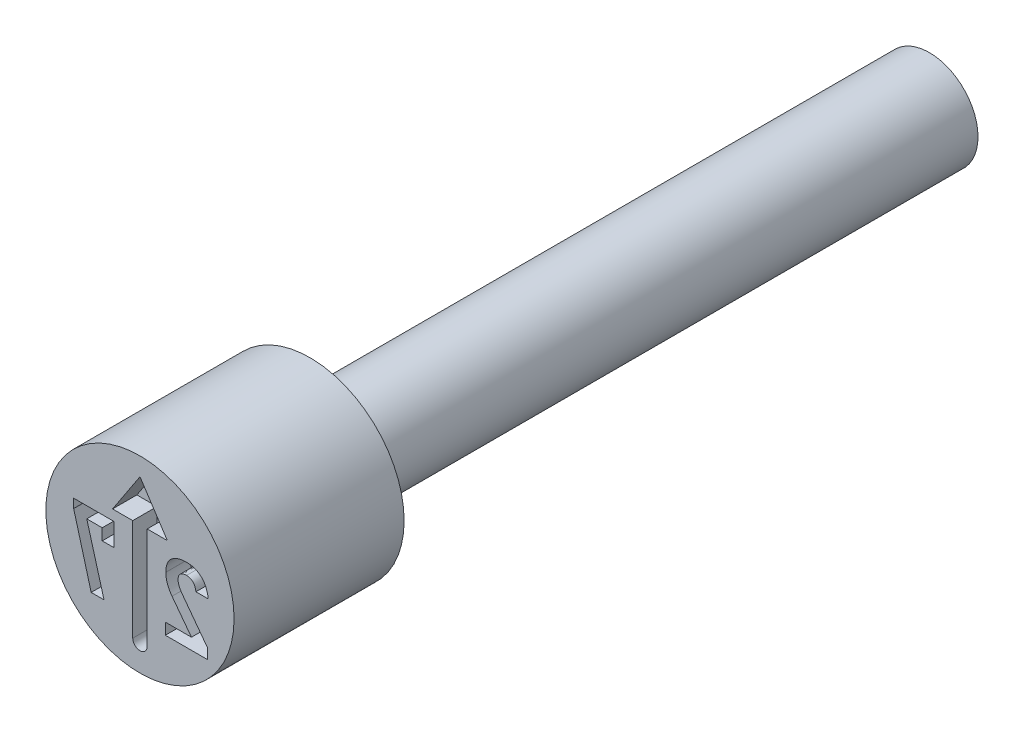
ISO-10303-21;
HEADER;
FILE_DESCRIPTION(('STEP AP214'),'2;1');
FILE_NAME('part.step','',(''),(''),'','','');
FILE_SCHEMA(('AUTOMOTIVE_DESIGN { 1 0 10303 214 1 1 1 1 }'));
ENDSEC;
DATA;
#1=APPLICATION_CONTEXT('core data for automotive mechanical design processes');
#2=APPLICATION_PROTOCOL_DEFINITION('international standard','automotive_design',2000,#1);
#3=PRODUCT_CONTEXT('',#1,'mechanical');
#4=PRODUCT('Part','Part','',(#3));
#5=PRODUCT_RELATED_PRODUCT_CATEGORY('part','',(#4));
#6=PRODUCT_DEFINITION_FORMATION('','',#4);
#7=PRODUCT_DEFINITION_CONTEXT('part definition',#1,'design');
#8=PRODUCT_DEFINITION('design','',#6,#7);
#9=PRODUCT_DEFINITION_SHAPE('','',#8);
#10=(LENGTH_UNIT() NAMED_UNIT(*) SI_UNIT(.MILLI.,.METRE.));
#11=(NAMED_UNIT(*) PLANE_ANGLE_UNIT() SI_UNIT($,.RADIAN.));
#12=(NAMED_UNIT(*) SI_UNIT($,.STERADIAN.) SOLID_ANGLE_UNIT());
#13=UNCERTAINTY_MEASURE_WITH_UNIT(LENGTH_MEASURE(1.E-05),#10,'distance_accuracy_value','');
#14=(GEOMETRIC_REPRESENTATION_CONTEXT(3) GLOBAL_UNCERTAINTY_ASSIGNED_CONTEXT((#13)) GLOBAL_UNIT_ASSIGNED_CONTEXT((#10,
#11,#12)) REPRESENTATION_CONTEXT('',''));
#15=CARTESIAN_POINT('',(0.,0.,0.));
#16=DIRECTION('',(0.,0.,1.));
#17=DIRECTION('',(1.,0.,0.));
#18=AXIS2_PLACEMENT_3D('',#15,#16,#17);
#19=CARTESIAN_POINT('',(0.,0.799999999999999,-2.8));
#20=DIRECTION('',(0.,0.,1.));
#21=DIRECTION('',(1.,0.,0.));
#22=AXIS2_PLACEMENT_3D('',#19,#20,#21);
#23=PLANE('',#22);
#24=CARTESIAN_POINT('',(0.,0.,-2.8));
#25=DIRECTION('',(0.,0.,1.));
#26=DIRECTION('',(1.,0.,0.));
#27=AXIS2_PLACEMENT_3D('',#24,#25,#26);
#28=CIRCLE('',#27,1.55);
#29=CARTESIAN_POINT('',(1.55,0.,-2.8));
#30=VERTEX_POINT('',#29);
#31=EDGE_CURVE('E11',#30,#30,#28,.T.);
#32=ORIENTED_EDGE('',*,*,#31,.F.);
#33=EDGE_LOOP('',(#32));
#34=FACE_BOUND('',#33,.T.);
#35=CARTESIAN_POINT('',(0.,0.,-2.8));
#36=DIRECTION('',(0.,0.,1.));
#37=DIRECTION('',(1.,0.,0.));
#38=AXIS2_PLACEMENT_3D('',#35,#36,#37);
#39=CIRCLE('',#38,0.799999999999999);
#40=CARTESIAN_POINT('',(0.799999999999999,0.,-2.8));
#41=VERTEX_POINT('',#40);
#42=EDGE_CURVE('E405',#41,#41,#39,.T.);
#43=ORIENTED_EDGE('',*,*,#42,.T.);
#44=EDGE_LOOP('',(#43));
#45=FACE_BOUND('',#44,.T.);
#46=ADVANCED_FACE('F39',(#34,#45),#23,.F.);
#47=CARTESIAN_POINT('',(0.,0.,-0.403888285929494));
#48=DIRECTION('',(0.,0.,1.));
#49=DIRECTION('',(1.,0.,0.));
#50=AXIS2_PLACEMENT_3D('',#47,#48,#49);
#51=CYLINDRICAL_SURFACE('',#50,1.55);
#52=CARTESIAN_POINT('',(0.,0.,0.));
#53=DIRECTION('',(0.,0.,1.));
#54=DIRECTION('',(1.,0.,0.));
#55=AXIS2_PLACEMENT_3D('',#52,#53,#54);
#56=CIRCLE('',#55,1.55);
#57=CARTESIAN_POINT('',(1.55,0.,0.));
#58=VERTEX_POINT('',#57);
#59=EDGE_CURVE('E46',#58,#58,#56,.T.);
#60=ORIENTED_EDGE('',*,*,#59,.F.);
#61=EDGE_LOOP('',(#60));
#62=FACE_BOUND('',#61,.T.);
#63=ORIENTED_EDGE('',*,*,#31,.T.);
#64=EDGE_LOOP('',(#63));
#65=FACE_BOUND('',#64,.T.);
#66=ADVANCED_FACE('F390',(#62,#65),#51,.T.);
#67=CARTESIAN_POINT('',(0.,1.55,0.));
#68=DIRECTION('',(0.,0.,-1.));
#69=DIRECTION('',(-1.,0.,0.));
#70=AXIS2_PLACEMENT_3D('',#67,#68,#69);
#71=PLANE('',#70);
#72=DIRECTION('',(0.,1.,0.));
#73=VECTOR('',#72,1.);
#74=CARTESIAN_POINT('',(1.1086504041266,-0.8,0.));
#75=LINE('',#74,#73);
#76=CARTESIAN_POINT('',(1.1086504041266,-0.8,0.));
#77=VERTEX_POINT('',#76);
#78=CARTESIAN_POINT('',(1.1086504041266,-0.626866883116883,0.));
#79=VERTEX_POINT('',#78);
#80=EDGE_CURVE('E640',#77,#79,#75,.T.);
#81=ORIENTED_EDGE('',*,*,#80,.F.);
#82=DIRECTION('',(1.,0.,0.));
#83=VECTOR('',#82,1.);
#84=CARTESIAN_POINT('',(0.418309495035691,-0.8,0.));
#85=LINE('',#84,#83);
#86=CARTESIAN_POINT('',(0.418309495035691,-0.8,0.));
#87=VERTEX_POINT('',#86);
#88=EDGE_CURVE('E53',#87,#77,#85,.T.);
#89=ORIENTED_EDGE('',*,*,#88,.F.);
#90=DIRECTION('',(0.,-1.,0.));
#91=VECTOR('',#90,1.);
#92=CARTESIAN_POINT('',(0.418309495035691,-0.612987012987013,0.));
#93=LINE('',#92,#91);
#94=CARTESIAN_POINT('',(0.418309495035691,-0.612987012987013,0.));
#95=VERTEX_POINT('',#94);
#96=EDGE_CURVE('E274',#95,#87,#93,.T.);
#97=ORIENTED_EDGE('',*,*,#96,.F.);
#98=DIRECTION('',(-1.,0.,0.));
#99=VECTOR('',#98,1.);
#100=CARTESIAN_POINT('',(0.848098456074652,-0.612987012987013,0.));
#101=LINE('',#100,#99);
#102=CARTESIAN_POINT('',(0.848098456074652,-0.612987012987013,0.));
#103=VERTEX_POINT('',#102);
#104=EDGE_CURVE('E277',#103,#95,#101,.T.);
#105=ORIENTED_EDGE('',*,*,#104,.F.);
#106=DIRECTION('',(0.601464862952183,-0.798899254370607,0.));
#107=VECTOR('',#106,1.);
#108=CARTESIAN_POINT('',(0.528374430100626,-0.188311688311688,0.));
#109=LINE('',#108,#107);
#110=CARTESIAN_POINT('',(0.528374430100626,-0.188311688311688,0.));
#111=VERTEX_POINT('',#110);
#112=EDGE_CURVE('E571',#111,#103,#109,.T.);
#113=ORIENTED_EDGE('',*,*,#112,.F.);
#114=CARTESIAN_POINT('',(0.424884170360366,0.100487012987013,0.));
#115=CARTESIAN_POINT('',(0.425203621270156,0.0882106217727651,0.));
#116=CARTESIAN_POINT('',(0.425845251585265,0.0635529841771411,0.));
#117=CARTESIAN_POINT('',(0.431394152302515,0.0264532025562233,0.));
#118=CARTESIAN_POINT('',(0.439406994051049,-0.011031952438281,0.));
#119=CARTESIAN_POINT('',(0.4515866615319,-0.0483617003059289,0.));
#120=CARTESIAN_POINT('',(0.466255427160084,-0.0853237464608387,0.));
#121=CARTESIAN_POINT('',(0.484140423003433,-0.121075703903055,0.));
#122=CARTESIAN_POINT('',(0.504550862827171,-0.155723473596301,0.));
#123=CARTESIAN_POINT('',(0.520395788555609,-0.177397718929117,0.));
#124=CARTESIAN_POINT('',(0.528374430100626,-0.188311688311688,0.));
#125=B_SPLINE_CURVE_WITH_KNOTS('',3,(#114,#115,#116,#117,#118,#119,#120,#121,#122,#123,#124),
.UNSPECIFIED.,.F.,.F.,(4,1,1,1,1,1,1,1,4),(0.,0.117962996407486,0.236933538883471,
0.360005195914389,0.486119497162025,0.613931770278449,0.74201296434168,0.870091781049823,1.),.UNSPECIFIED.);
#126=CARTESIAN_POINT('',(0.424884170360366,0.100487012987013,0.));
#127=VERTEX_POINT('',#126);
#128=EDGE_CURVE('E574',#127,#111,#125,.T.);
#129=ORIENTED_EDGE('',*,*,#128,.F.);
#130=DIRECTION('',(0.,-1.,0.));
#131=VECTOR('',#130,1.);
#132=CARTESIAN_POINT('',(0.424884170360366,0.101217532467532,0.));
#133=LINE('',#132,#131);
#134=CARTESIAN_POINT('',(0.424884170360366,0.101217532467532,0.));
#135=VERTEX_POINT('',#134);
#136=EDGE_CURVE('E579',#135,#127,#133,.T.);
#137=ORIENTED_EDGE('',*,*,#136,.F.);
#138=CARTESIAN_POINT('',(0.769932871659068,0.415584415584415,0.));
#139=CARTESIAN_POINT('',(0.756529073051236,0.415389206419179,0.));
#140=CARTESIAN_POINT('',(0.730472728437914,0.415009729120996,0.));
#141=CARTESIAN_POINT('',(0.692635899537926,0.410971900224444,0.));
#142=CARTESIAN_POINT('',(0.657096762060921,0.404770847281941,0.));
#143=CARTESIAN_POINT('',(0.623885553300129,0.395815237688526,0.));
#144=CARTESIAN_POINT('',(0.593068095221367,0.384102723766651,0.));
#145=CARTESIAN_POINT('',(0.564615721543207,0.369880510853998,0.));
#146=CARTESIAN_POINT('',(0.53834281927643,0.353356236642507,0.));
#147=CARTESIAN_POINT('',(0.514638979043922,0.333969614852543,0.));
#148=CARTESIAN_POINT('',(0.493470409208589,0.312341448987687,0.));
#149=CARTESIAN_POINT('',(0.474950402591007,0.288551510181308,0.));
#150=CARTESIAN_POINT('',(0.459663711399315,0.262394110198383,0.));
#151=CARTESIAN_POINT('',(0.446516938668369,0.234396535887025,0.));
#152=CARTESIAN_POINT('',(0.437000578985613,0.203950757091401,0.));
#153=CARTESIAN_POINT('',(0.429837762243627,0.171627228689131,0.));
#154=CARTESIAN_POINT('',(0.425738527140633,0.137117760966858,0.));
#155=CARTESIAN_POINT('',(0.425174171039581,0.113403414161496,0.));
#156=CARTESIAN_POINT('',(0.424884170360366,0.101217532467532,0.));
#157=B_SPLINE_CURVE_WITH_KNOTS('',3,(#138,#139,#140,#141,#142,#143,#144,#145,#146,#147,#148,
#149,#150,#151,#152,#153,#154,#155,#156),.UNSPECIFIED.,.F.,.F.,(4,1,1,1,1,1,1,1,1,1,1,1,1,1,1,1,
4),(0.,0.0757177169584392,0.147191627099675,0.214761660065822,0.279410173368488,
0.341256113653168,0.400743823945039,0.458895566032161,0.516277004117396,0.573364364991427,
0.629605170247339,0.686164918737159,0.744246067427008,0.804009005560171,0.865999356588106,
0.931142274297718,1.),.UNSPECIFIED.);
#158=CARTESIAN_POINT('',(0.769932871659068,0.415584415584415,0.));
#159=VERTEX_POINT('',#158);
#160=EDGE_CURVE('E585',#159,#135,#157,.T.);
#161=ORIENTED_EDGE('',*,*,#160,.F.);
#162=CARTESIAN_POINT('',(1.12326079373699,0.0719967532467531,0.));
#163=CARTESIAN_POINT('',(1.12170313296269,0.0853448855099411,0.));
#164=CARTESIAN_POINT('',(1.11866286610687,0.111397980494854,0.));
#165=CARTESIAN_POINT('',(1.11039367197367,0.148941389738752,0.));
#166=CARTESIAN_POINT('',(1.10027587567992,0.184247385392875,0.));
#167=CARTESIAN_POINT('',(1.08760022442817,0.217269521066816,0.));
#168=CARTESIAN_POINT('',(1.07247363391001,0.247960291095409,0.));
#169=CARTESIAN_POINT('',(1.05523393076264,0.276546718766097,0.));
#170=CARTESIAN_POINT('',(1.03502060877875,0.302342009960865,0.));
#171=CARTESIAN_POINT('',(1.01296453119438,0.326116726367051,0.));
#172=CARTESIAN_POINT('',(0.988500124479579,0.347012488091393,0.));
#173=CARTESIAN_POINT('',(0.962338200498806,0.36538319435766,0.));
#174=CARTESIAN_POINT('',(0.934484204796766,0.381067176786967,0.));
#175=CARTESIAN_POINT('',(0.904847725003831,0.39378774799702,0.));
#176=CARTESIAN_POINT('',(0.873474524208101,0.403470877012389,0.));
#177=CARTESIAN_POINT('',(0.840489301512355,0.410575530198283,0.));
#178=CARTESIAN_POINT('',(0.805752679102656,0.414719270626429,0.));
#179=CARTESIAN_POINT('',(0.782038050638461,0.415292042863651,0.));
#180=CARTESIAN_POINT('',(0.769932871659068,0.415584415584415,0.));
#181=B_SPLINE_CURVE_WITH_KNOTS('',3,(#162,#163,#164,#165,#166,#167,#168,#169,#170,#171,#172,
#173,#174,#175,#176,#177,#178,#179,#180),.UNSPECIFIED.,.F.,.F.,(4,1,1,1,1,1,1,1,1,1,1,1,1,1,1,1,
4),(0.,0.0735286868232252,0.143514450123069,0.210169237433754,0.274454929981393,
0.336856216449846,0.397291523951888,0.456843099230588,0.515945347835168,0.574554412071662,
0.632618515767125,0.690713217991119,0.749236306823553,0.808827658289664,0.870185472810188,
0.933735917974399,1.),.UNSPECIFIED.);
#182=CARTESIAN_POINT('',(1.12326079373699,0.0719967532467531,0.));
#183=VERTEX_POINT('',#182);
#184=EDGE_CURVE('E590',#183,#159,#181,.T.);
#185=ORIENTED_EDGE('',*,*,#184,.F.);
#186=DIRECTION('',(0.,1.,0.));
#187=VECTOR('',#186,1.);
#188=CARTESIAN_POINT('',(1.12326079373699,0.0712662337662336,0.));
#189=LINE('',#188,#187);
#190=CARTESIAN_POINT('',(1.12326079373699,0.0712662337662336,0.));
#191=VERTEX_POINT('',#190);
#192=EDGE_CURVE('E598',#191,#183,#189,.T.);
#193=ORIENTED_EDGE('',*,*,#192,.F.);
#194=DIRECTION('',(1.,0.,0.));
#195=VECTOR('',#194,1.);
#196=CARTESIAN_POINT('',(0.9211504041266,0.0712662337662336,0.));
#197=LINE('',#196,#195);
#198=CARTESIAN_POINT('',(0.9211504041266,0.0712662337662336,0.));
#199=VERTEX_POINT('',#198);
#200=EDGE_CURVE('E604',#199,#191,#197,.T.);
#201=ORIENTED_EDGE('',*,*,#200,.F.);
#202=DIRECTION('',(0.,-1.,0.));
#203=VECTOR('',#202,1.);
#204=CARTESIAN_POINT('',(0.9211504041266,0.0719967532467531,0.));
#205=LINE('',#204,#203);
#206=CARTESIAN_POINT('',(0.9211504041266,0.0719967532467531,0.));
#207=VERTEX_POINT('',#206);
#208=EDGE_CURVE('E607',#207,#199,#205,.T.);
#209=ORIENTED_EDGE('',*,*,#208,.F.);
#210=CARTESIAN_POINT('',(0.768228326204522,0.228571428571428,0.));
#211=CARTESIAN_POINT('',(0.778355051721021,0.228193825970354,0.));
#212=CARTESIAN_POINT('',(0.797963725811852,0.227462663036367,0.));
#213=CARTESIAN_POINT('',(0.825796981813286,0.219201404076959,0.));
#214=CARTESIAN_POINT('',(0.851030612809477,0.206508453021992,0.));
#215=CARTESIAN_POINT('',(0.872773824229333,0.188167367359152,0.));
#216=CARTESIAN_POINT('',(0.891048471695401,0.165305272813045,0.));
#217=CARTESIAN_POINT('',(0.9055351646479,0.13810072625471,0.));
#218=CARTESIAN_POINT('',(0.915677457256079,0.106476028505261,0.));
#219=CARTESIAN_POINT('',(0.919271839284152,0.0838316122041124,0.));
#220=CARTESIAN_POINT('',(0.9211504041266,0.0719967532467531,0.));
#221=B_SPLINE_CURVE_WITH_KNOTS('',3,(#210,#211,#212,#213,#214,#215,#216,#217,#218,#219,#220),
.UNSPECIFIED.,.F.,.F.,(4,1,1,1,1,1,1,1,4),(0.,0.124986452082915,0.242014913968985,
0.3561482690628,0.472436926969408,0.591058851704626,0.716468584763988,0.851815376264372,1.),.UNSPECIFIED.);
#222=CARTESIAN_POINT('',(0.768228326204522,0.228571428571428,0.));
#223=VERTEX_POINT('',#222);
#224=EDGE_CURVE('E610',#223,#207,#221,.T.);
#225=ORIENTED_EDGE('',*,*,#224,.F.);
#226=CARTESIAN_POINT('',(0.627725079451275,0.101217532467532,0.));
#227=CARTESIAN_POINT('',(0.628053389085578,0.110847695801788,0.));
#228=CARTESIAN_POINT('',(0.628681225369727,0.129263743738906,0.));
#229=CARTESIAN_POINT('',(0.635963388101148,0.155042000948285,0.));
#230=CARTESIAN_POINT('',(0.647538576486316,0.177472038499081,0.));
#231=CARTESIAN_POINT('',(0.664043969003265,0.196031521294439,0.));
#232=CARTESIAN_POINT('',(0.68457959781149,0.210800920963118,0.));
#233=CARTESIAN_POINT('',(0.70911445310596,0.221457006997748,0.));
#234=CARTESIAN_POINT('',(0.737516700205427,0.227328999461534,0.));
#235=CARTESIAN_POINT('',(0.757649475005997,0.228143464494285,0.));
#236=CARTESIAN_POINT('',(0.768228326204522,0.228571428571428,0.));
#237=B_SPLINE_CURVE_WITH_KNOTS('',3,(#226,#227,#228,#229,#230,#231,#232,#233,#234,#235,#236),
.UNSPECIFIED.,.F.,.F.,(4,1,1,1,1,1,1,1,4),(0.,0.133827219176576,0.255921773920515,
0.369738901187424,0.482715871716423,0.598532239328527,0.719553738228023,0.852638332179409,1.),.UNSPECIFIED.);
#238=CARTESIAN_POINT('',(0.627725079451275,0.101217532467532,0.));
#239=VERTEX_POINT('',#238);
#240=EDGE_CURVE('E615',#239,#223,#237,.T.);
#241=ORIENTED_EDGE('',*,*,#240,.F.);
#242=DIRECTION('',(0.,1.,0.));
#243=VECTOR('',#242,1.);
#244=CARTESIAN_POINT('',(0.627725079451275,0.0995129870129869,0.));
#245=LINE('',#244,#243);
#246=CARTESIAN_POINT('',(0.627725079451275,0.0995129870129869,0.));
#247=VERTEX_POINT('',#246);
#248=EDGE_CURVE('E623',#247,#239,#245,.T.);
#249=ORIENTED_EDGE('',*,*,#248,.F.);
#250=CARTESIAN_POINT('',(0.695176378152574,-0.072646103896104,0.));
#251=CARTESIAN_POINT('',(0.690059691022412,-0.0655616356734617,0.));
#252=CARTESIAN_POINT('',(0.679970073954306,-0.0515917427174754,0.));
#253=CARTESIAN_POINT('',(0.666468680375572,-0.0298716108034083,0.));
#254=CARTESIAN_POINT('',(0.655095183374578,-0.00764483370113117,0.));
#255=CARTESIAN_POINT('',(0.645287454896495,0.0146779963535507,0.));
#256=CARTESIAN_POINT('',(0.637605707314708,0.0368377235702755,0.));
#257=CARTESIAN_POINT('',(0.631801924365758,0.0583656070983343,0.));
#258=CARTESIAN_POINT('',(0.628600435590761,0.0792063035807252,0.));
#259=CARTESIAN_POINT('',(0.628012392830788,0.0928478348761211,0.));
#260=CARTESIAN_POINT('',(0.627725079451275,0.0995129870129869,0.));
#261=B_SPLINE_CURVE_WITH_KNOTS('',3,(#250,#251,#252,#253,#254,#255,#256,#257,#258,#259,#260),
.UNSPECIFIED.,.F.,.F.,(4,1,1,1,1,1,1,1,4),(0.,0.139527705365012,0.275135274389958,
0.407888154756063,0.537917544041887,0.66417107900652,0.782063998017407,0.893518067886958,1.),.UNSPECIFIED.);
#262=CARTESIAN_POINT('',(0.695176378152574,-0.072646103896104,0.));
#263=VERTEX_POINT('',#262);
#264=EDGE_CURVE('E629',#263,#247,#261,.T.);
#265=ORIENTED_EDGE('',*,*,#264,.F.);
#266=DIRECTION('',(-0.597969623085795,0.801518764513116,0.));
#267=VECTOR('',#266,1.);
#268=CARTESIAN_POINT('',(1.1086504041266,-0.626866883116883,0.));
#269=LINE('',#268,#267);
#270=EDGE_CURVE('E634',#79,#263,#269,.T.);
#271=ORIENTED_EDGE('',*,*,#270,.F.);
#272=EDGE_LOOP('',(#81,#89,#97,#105,#113,#129,#137,#161,#185,#193,#201,#209,#225,#241,#249,#265,#271));
#273=FACE_BOUND('',#272,.T.);
#274=DIRECTION('',(0.,-1.,0.));
#275=VECTOR('',#274,1.);
#276=CARTESIAN_POINT('',(-1.09168401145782,0.4,0.));
#277=LINE('',#276,#275);
#278=CARTESIAN_POINT('',(-1.09168401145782,0.4,0.));
#279=VERTEX_POINT('',#278);
#280=CARTESIAN_POINT('',(-1.09168401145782,0.251461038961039,0.));
#281=VERTEX_POINT('',#280);
#282=EDGE_CURVE('E510',#279,#281,#277,.T.);
#283=ORIENTED_EDGE('',*,*,#282,.F.);
#284=DIRECTION('',(-1.,0.,0.));
#285=VECTOR('',#284,1.);
#286=CARTESIAN_POINT('',(-0.425206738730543,0.4,0.));
#287=LINE('',#286,#285);
#288=CARTESIAN_POINT('',(-0.425206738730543,0.4,0.));
#289=VERTEX_POINT('',#288);
#290=EDGE_CURVE('E61',#289,#279,#287,.T.);
#291=ORIENTED_EDGE('',*,*,#290,.F.);
#292=DIRECTION('',(0.,1.,0.));
#293=VECTOR('',#292,1.);
#294=CARTESIAN_POINT('',(-0.425206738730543,0.0259740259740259,0.));
#295=LINE('',#294,#293);
#296=CARTESIAN_POINT('',(-0.425206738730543,0.0259740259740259,0.));
#297=VERTEX_POINT('',#296);
#298=EDGE_CURVE('E488',#297,#289,#295,.T.);
#299=ORIENTED_EDGE('',*,*,#298,.F.);
#300=DIRECTION('',(1.,0.,0.));
#301=VECTOR('',#300,1.);
#302=CARTESIAN_POINT('',(-0.621472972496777,0.0259740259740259,0.));
#303=LINE('',#302,#301);
#304=CARTESIAN_POINT('',(-0.621472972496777,0.0259740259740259,0.));
#305=VERTEX_POINT('',#304);
#306=EDGE_CURVE('E492',#305,#297,#303,.T.);
#307=ORIENTED_EDGE('',*,*,#306,.F.);
#308=DIRECTION('',(0.,-1.,0.));
#309=VECTOR('',#308,1.);
#310=CARTESIAN_POINT('',(-0.621472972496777,0.212987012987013,0.));
#311=LINE('',#310,#309);
#312=CARTESIAN_POINT('',(-0.621472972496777,0.212987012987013,0.));
#313=VERTEX_POINT('',#312);
#314=EDGE_CURVE('E495',#313,#305,#311,.T.);
#315=ORIENTED_EDGE('',*,*,#314,.F.);
#316=DIRECTION('',(1.,0.,0.));
#317=VECTOR('',#316,1.);
#318=CARTESIAN_POINT('',(-0.876180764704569,0.212987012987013,0.));
#319=LINE('',#318,#317);
#320=CARTESIAN_POINT('',(-0.876180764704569,0.212987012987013,0.));
#321=VERTEX_POINT('',#320);
#322=EDGE_CURVE('E498',#321,#313,#319,.T.);
#323=ORIENTED_EDGE('',*,*,#322,.F.);
#324=DIRECTION('',(-0.270102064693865,0.962831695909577,0.));
#325=VECTOR('',#324,1.);
#326=CARTESIAN_POINT('',(-0.592008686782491,-0.8,0.));
#327=LINE('',#326,#325);
#328=CARTESIAN_POINT('',(-0.592008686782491,-0.8,0.));
#329=VERTEX_POINT('',#328);
#330=EDGE_CURVE('E501',#329,#321,#327,.T.);
#331=ORIENTED_EDGE('',*,*,#330,.F.);
#332=DIRECTION('',(1.,0.,0.));
#333=VECTOR('',#332,1.);
#334=CARTESIAN_POINT('',(-0.803128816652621,-0.8,0.));
#335=LINE('',#334,#333);
#336=CARTESIAN_POINT('',(-0.803128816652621,-0.8,0.));
#337=VERTEX_POINT('',#336);
#338=EDGE_CURVE('E504',#337,#329,#335,.T.);
#339=ORIENTED_EDGE('',*,*,#338,.F.);
#340=DIRECTION('',(0.264647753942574,-0.964345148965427,0.));
#341=VECTOR('',#340,1.);
#342=CARTESIAN_POINT('',(-1.09168401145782,0.251461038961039,0.));
#343=LINE('',#342,#341);
#344=EDGE_CURVE('E507',#281,#337,#343,.T.);
#345=ORIENTED_EDGE('',*,*,#344,.F.);
#346=EDGE_LOOP('',(#283,#291,#299,#307,#315,#323,#331,#339,#345));
#347=FACE_BOUND('',#346,.T.);
#348=DIRECTION('',(0.,1.,0.));
#349=VECTOR('',#348,1.);
#350=CARTESIAN_POINT('',(0.119045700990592,0.566469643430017,0.));
#351=LINE('',#350,#349);
#352=CARTESIAN_POINT('',(0.119045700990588,-1.11010114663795,0.));
#353=VERTEX_POINT('',#352);
#354=CARTESIAN_POINT('',(0.119045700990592,0.566469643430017,0.));
#355=VERTEX_POINT('',#354);
#356=EDGE_CURVE('E444',#353,#355,#351,.T.);
#357=ORIENTED_EDGE('',*,*,#356,.F.);
#358=CARTESIAN_POINT('',(1.02140308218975E-13,-1.11010114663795,0.));
#359=DIRECTION('',(0.,0.,1.));
#360=DIRECTION('',(1.,0.,0.));
#361=AXIS2_PLACEMENT_3D('',#358,#359,#360);
#362=CIRCLE('',#361,0.119045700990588);
#363=CARTESIAN_POINT('',(-0.119045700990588,-1.11010114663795,0.));
#364=VERTEX_POINT('',#363);
#365=EDGE_CURVE('E447',#364,#353,#362,.T.);
#366=ORIENTED_EDGE('',*,*,#365,.F.);
#367=DIRECTION('',(0.,-1.,0.));
#368=VECTOR('',#367,1.);
#369=CARTESIAN_POINT('',(-0.119045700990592,0.566469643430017,0.));
#370=LINE('',#369,#368);
#371=CARTESIAN_POINT('',(-0.119045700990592,0.566469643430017,0.));
#372=VERTEX_POINT('',#371);
#373=EDGE_CURVE('E428',#372,#364,#370,.T.);
#374=ORIENTED_EDGE('',*,*,#373,.F.);
#375=DIRECTION('',(1.,0.,0.));
#376=VECTOR('',#375,1.);
#377=CARTESIAN_POINT('',(-0.451198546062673,0.566469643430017,0.));
#378=LINE('',#377,#376);
#379=CARTESIAN_POINT('',(-0.451198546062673,0.566469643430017,0.));
#380=VERTEX_POINT('',#379);
#381=EDGE_CURVE('E432',#380,#372,#378,.T.);
#382=ORIENTED_EDGE('',*,*,#381,.F.);
#383=DIRECTION('',(-0.550159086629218,-0.835059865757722,0.));
#384=VECTOR('',#383,1.);
#385=CARTESIAN_POINT('',(0.,1.25132209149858,0.));
#386=LINE('',#385,#384);
#387=CARTESIAN_POINT('',(0.,1.25132209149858,0.));
#388=VERTEX_POINT('',#387);
#389=EDGE_CURVE('E435',#388,#380,#386,.T.);
#390=ORIENTED_EDGE('',*,*,#389,.F.);
#391=DIRECTION('',(-0.550159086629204,0.835059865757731,0.));
#392=VECTOR('',#391,1.);
#393=CARTESIAN_POINT('',(0.,1.25132209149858,0.));
#394=LINE('',#393,#392);
#395=CARTESIAN_POINT('',(0.451198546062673,0.566469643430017,0.));
#396=VERTEX_POINT('',#395);
#397=EDGE_CURVE('E438',#396,#388,#394,.T.);
#398=ORIENTED_EDGE('',*,*,#397,.F.);
#399=DIRECTION('',(1.,0.,0.));
#400=VECTOR('',#399,1.);
#401=CARTESIAN_POINT('',(0.451198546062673,0.566469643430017,0.));
#402=LINE('',#401,#400);
#403=EDGE_CURVE('E441',#355,#396,#402,.T.);
#404=ORIENTED_EDGE('',*,*,#403,.F.);
#405=EDGE_LOOP('',(#357,#366,#374,#382,#390,#398,#404));
#406=FACE_BOUND('',#405,.T.);
#407=ORIENTED_EDGE('',*,*,#59,.T.);
#408=EDGE_LOOP('',(#407));
#409=FACE_BOUND('',#408,.T.);
#410=ADVANCED_FACE('F387',(#273,#347,#406,#409),#71,.F.);
#411=CARTESIAN_POINT('',(0.,0.,-13.));
#412=DIRECTION('',(0.,0.,1.));
#413=DIRECTION('',(1.,0.,0.));
#414=AXIS2_PLACEMENT_3D('',#411,#412,#413);
#415=PLANE('',#414);
#416=CARTESIAN_POINT('',(0.,0.,-13.));
#417=DIRECTION('',(0.,0.,1.));
#418=DIRECTION('',(1.,0.,0.));
#419=AXIS2_PLACEMENT_3D('',#416,#417,#418);
#420=CIRCLE('',#419,0.8);
#421=CARTESIAN_POINT('',(0.8,0.,-13.));
#422=VERTEX_POINT('',#421);
#423=EDGE_CURVE('E406',#422,#422,#420,.T.);
#424=ORIENTED_EDGE('',*,*,#423,.F.);
#425=EDGE_LOOP('',(#424));
#426=FACE_BOUND('',#425,.T.);
#427=ADVANCED_FACE('F383',(#426),#415,.F.);
#428=CARTESIAN_POINT('',(0.,0.,-0.403888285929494));
#429=DIRECTION('',(0.,0.,1.));
#430=DIRECTION('',(1.,0.,0.));
#431=AXIS2_PLACEMENT_3D('',#428,#429,#430);
#432=CYLINDRICAL_SURFACE('',#431,0.8);
#433=ORIENTED_EDGE('',*,*,#42,.F.);
#434=EDGE_LOOP('',(#433));
#435=FACE_BOUND('',#434,.T.);
#436=ORIENTED_EDGE('',*,*,#423,.T.);
#437=EDGE_LOOP('',(#436));
#438=FACE_BOUND('',#437,.T.);
#439=ADVANCED_FACE('F379',(#435,#438),#432,.T.);
#440=CARTESIAN_POINT('',(1.02140308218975E-13,-1.11010114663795,-0.4));
#441=DIRECTION('',(0.,0.,1.));
#442=DIRECTION('',(1.,0.,0.));
#443=AXIS2_PLACEMENT_3D('',#440,#441,#442);
#444=CYLINDRICAL_SURFACE('',#443,0.119045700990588);
#445=ORIENTED_EDGE('',*,*,#365,.T.);
#446=DIRECTION('',(0.,0.,1.));
#447=VECTOR('',#446,1.);
#448=CARTESIAN_POINT('',(0.119045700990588,-1.11010114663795,-0.4));
#449=LINE('',#448,#447);
#450=CARTESIAN_POINT('',(0.119045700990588,-1.11010114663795,-0.4));
#451=VERTEX_POINT('',#450);
#452=EDGE_CURVE('E414',#451,#353,#449,.T.);
#453=ORIENTED_EDGE('',*,*,#452,.F.);
#454=CARTESIAN_POINT('',(1.02140308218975E-13,-1.11010114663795,-0.4));
#455=DIRECTION('',(0.,0.,1.));
#456=DIRECTION('',(1.,0.,0.));
#457=AXIS2_PLACEMENT_3D('',#454,#455,#456);
#458=CIRCLE('',#457,0.119045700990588);
#459=CARTESIAN_POINT('',(-0.119045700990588,-1.11010114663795,-0.4));
#460=VERTEX_POINT('',#459);
#461=EDGE_CURVE('E431',#460,#451,#458,.T.);
#462=ORIENTED_EDGE('',*,*,#461,.F.);
#463=DIRECTION('',(0.,0.,1.));
#464=VECTOR('',#463,1.);
#465=CARTESIAN_POINT('',(-0.119045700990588,-1.11010114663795,-0.4));
#466=LINE('',#465,#464);
#467=EDGE_CURVE('E407',#460,#364,#466,.T.);
#468=ORIENTED_EDGE('',*,*,#467,.T.);
#469=EDGE_LOOP('',(#445,#453,#462,#468));
#470=FACE_BOUND('',#469,.T.);
#471=ADVANCED_FACE('F357',(#470),#444,.F.);
#472=CARTESIAN_POINT('',(-0.119045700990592,0.566469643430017,-0.4));
#473=DIRECTION('',(-1.,0.,0.));
#474=DIRECTION('',(0.,-1.,0.));
#475=AXIS2_PLACEMENT_3D('',#472,#473,#474);
#476=PLANE('',#475);
#477=ORIENTED_EDGE('',*,*,#373,.T.);
#478=ORIENTED_EDGE('',*,*,#467,.F.);
#479=DIRECTION('',(0.,-1.,0.));
#480=VECTOR('',#479,1.);
#481=CARTESIAN_POINT('',(-0.119045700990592,0.566469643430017,-0.4));
#482=LINE('',#481,#480);
#483=CARTESIAN_POINT('',(-0.119045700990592,0.566469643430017,-0.4));
#484=VERTEX_POINT('',#483);
#485=EDGE_CURVE('E419',#484,#460,#482,.T.);
#486=ORIENTED_EDGE('',*,*,#485,.F.);
#487=DIRECTION('',(0.,0.,1.));
#488=VECTOR('',#487,1.);
#489=CARTESIAN_POINT('',(-0.119045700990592,0.566469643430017,-0.4));
#490=LINE('',#489,#488);
#491=EDGE_CURVE('E411',#484,#372,#490,.T.);
#492=ORIENTED_EDGE('',*,*,#491,.T.);
#493=EDGE_LOOP('',(#477,#478,#486,#492));
#494=FACE_BOUND('',#493,.T.);
#495=ADVANCED_FACE('F353',(#494),#476,.F.);
#496=CARTESIAN_POINT('',(-0.451198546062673,0.566469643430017,-0.4));
#497=DIRECTION('',(0.,-1.,0.));
#498=DIRECTION('',(0.,0.,-1.));
#499=AXIS2_PLACEMENT_3D('',#496,#497,#498);
#500=PLANE('',#499);
#501=ORIENTED_EDGE('',*,*,#381,.T.);
#502=ORIENTED_EDGE('',*,*,#491,.F.);
#503=DIRECTION('',(1.,0.,0.));
#504=VECTOR('',#503,1.);
#505=CARTESIAN_POINT('',(-0.451198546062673,0.566469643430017,-0.4));
#506=LINE('',#505,#504);
#507=CARTESIAN_POINT('',(-0.451198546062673,0.566469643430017,-0.4));
#508=VERTEX_POINT('',#507);
#509=EDGE_CURVE('E452',#508,#484,#506,.T.);
#510=ORIENTED_EDGE('',*,*,#509,.F.);
#511=DIRECTION('',(0.,0.,1.));
#512=VECTOR('',#511,1.);
#513=CARTESIAN_POINT('',(-0.451198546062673,0.566469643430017,-0.4));
#514=LINE('',#513,#512);
#515=EDGE_CURVE('E425',#508,#380,#514,.T.);
#516=ORIENTED_EDGE('',*,*,#515,.T.);
#517=EDGE_LOOP('',(#501,#502,#510,#516));
#518=FACE_BOUND('',#517,.T.);
#519=ADVANCED_FACE('F356',(#518),#500,.F.);
#520=CARTESIAN_POINT('',(0.,1.25132209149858,-0.4));
#521=DIRECTION('',(-0.835059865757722,0.550159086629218,0.));
#522=DIRECTION('',(-0.550159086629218,-0.835059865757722,0.));
#523=AXIS2_PLACEMENT_3D('',#520,#521,#522);
#524=PLANE('',#523);
#525=ORIENTED_EDGE('',*,*,#389,.T.);
#526=ORIENTED_EDGE('',*,*,#515,.F.);
#527=DIRECTION('',(-0.550159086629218,-0.835059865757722,0.));
#528=VECTOR('',#527,1.);
#529=CARTESIAN_POINT('',(0.,1.25132209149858,-0.4));
#530=LINE('',#529,#528);
#531=CARTESIAN_POINT('',(0.,1.25132209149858,-0.4));
#532=VERTEX_POINT('',#531);
#533=EDGE_CURVE('E455',#532,#508,#530,.T.);
#534=ORIENTED_EDGE('',*,*,#533,.F.);
#535=DIRECTION('',(0.,0.,1.));
#536=VECTOR('',#535,1.);
#537=CARTESIAN_POINT('',(0.,1.25132209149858,-0.4));
#538=LINE('',#537,#536);
#539=EDGE_CURVE('E423',#532,#388,#538,.T.);
#540=ORIENTED_EDGE('',*,*,#539,.T.);
#541=EDGE_LOOP('',(#525,#526,#534,#540));
#542=FACE_BOUND('',#541,.T.);
#543=ADVANCED_FACE('F361',(#542),#524,.F.);
#544=CARTESIAN_POINT('',(0.,1.25132209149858,-0.4));
#545=DIRECTION('',(0.835059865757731,0.550159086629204,0.));
#546=DIRECTION('',(-0.550159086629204,0.835059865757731,0.));
#547=AXIS2_PLACEMENT_3D('',#544,#545,#546);
#548=PLANE('',#547);
#549=ORIENTED_EDGE('',*,*,#397,.T.);
#550=ORIENTED_EDGE('',*,*,#539,.F.);
#551=DIRECTION('',(-0.550159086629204,0.835059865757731,0.));
#552=VECTOR('',#551,1.);
#553=CARTESIAN_POINT('',(0.,1.25132209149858,-0.4));
#554=LINE('',#553,#552);
#555=CARTESIAN_POINT('',(0.451198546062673,0.566469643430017,-0.4));
#556=VERTEX_POINT('',#555);
#557=EDGE_CURVE('E458',#556,#532,#554,.T.);
#558=ORIENTED_EDGE('',*,*,#557,.F.);
#559=DIRECTION('',(0.,0.,1.));
#560=VECTOR('',#559,1.);
#561=CARTESIAN_POINT('',(0.451198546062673,0.566469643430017,-0.4));
#562=LINE('',#561,#560);
#563=EDGE_CURVE('E421',#556,#396,#562,.T.);
#564=ORIENTED_EDGE('',*,*,#563,.T.);
#565=EDGE_LOOP('',(#549,#550,#558,#564));
#566=FACE_BOUND('',#565,.T.);
#567=ADVANCED_FACE('F365',(#566),#548,.F.);
#568=CARTESIAN_POINT('',(0.451198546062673,0.566469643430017,-0.4));
#569=DIRECTION('',(0.,-1.,0.));
#570=DIRECTION('',(0.,0.,-1.));
#571=AXIS2_PLACEMENT_3D('',#568,#569,#570);
#572=PLANE('',#571);
#573=ORIENTED_EDGE('',*,*,#403,.T.);
#574=ORIENTED_EDGE('',*,*,#563,.F.);
#575=DIRECTION('',(1.,0.,0.));
#576=VECTOR('',#575,1.);
#577=CARTESIAN_POINT('',(0.451198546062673,0.566469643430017,-0.4));
#578=LINE('',#577,#576);
#579=CARTESIAN_POINT('',(0.119045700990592,0.566469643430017,-0.4));
#580=VERTEX_POINT('',#579);
#581=EDGE_CURVE('E461',#580,#556,#578,.T.);
#582=ORIENTED_EDGE('',*,*,#581,.F.);
#583=DIRECTION('',(0.,0.,1.));
#584=VECTOR('',#583,1.);
#585=CARTESIAN_POINT('',(0.119045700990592,0.566469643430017,-0.4));
#586=LINE('',#585,#584);
#587=EDGE_CURVE('E418',#580,#355,#586,.T.);
#588=ORIENTED_EDGE('',*,*,#587,.T.);
#589=EDGE_LOOP('',(#573,#574,#582,#588));
#590=FACE_BOUND('',#589,.T.);
#591=ADVANCED_FACE('F369',(#590),#572,.F.);
#592=CARTESIAN_POINT('',(0.119045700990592,0.566469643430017,-0.4));
#593=DIRECTION('',(1.,0.,0.));
#594=DIRECTION('',(0.,1.,0.));
#595=AXIS2_PLACEMENT_3D('',#592,#593,#594);
#596=PLANE('',#595);
#597=ORIENTED_EDGE('',*,*,#356,.T.);
#598=ORIENTED_EDGE('',*,*,#587,.F.);
#599=DIRECTION('',(0.,1.,0.));
#600=VECTOR('',#599,1.);
#601=CARTESIAN_POINT('',(0.119045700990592,0.566469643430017,-0.4));
#602=LINE('',#601,#600);
#603=EDGE_CURVE('E464',#451,#580,#602,.T.);
#604=ORIENTED_EDGE('',*,*,#603,.F.);
#605=ORIENTED_EDGE('',*,*,#452,.T.);
#606=EDGE_LOOP('',(#597,#598,#604,#605));
#607=FACE_BOUND('',#606,.T.);
#608=ADVANCED_FACE('F351',(#607),#596,.F.);
#609=CARTESIAN_POINT('',(1.02140308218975E-13,-1.11010114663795,-0.4));
#610=DIRECTION('',(0.,0.,1.));
#611=DIRECTION('',(1.,0.,0.));
#612=AXIS2_PLACEMENT_3D('',#609,#610,#611);
#613=PLANE('',#612);
#614=ORIENTED_EDGE('',*,*,#461,.T.);
#615=ORIENTED_EDGE('',*,*,#603,.T.);
#616=ORIENTED_EDGE('',*,*,#581,.T.);
#617=ORIENTED_EDGE('',*,*,#557,.T.);
#618=ORIENTED_EDGE('',*,*,#533,.T.);
#619=ORIENTED_EDGE('',*,*,#509,.T.);
#620=ORIENTED_EDGE('',*,*,#485,.T.);
#621=EDGE_LOOP('',(#614,#615,#616,#617,#618,#619,#620));
#622=FACE_BOUND('',#621,.T.);
#623=ADVANCED_FACE('F348',(#622),#613,.T.);
#624=CARTESIAN_POINT('',(-0.425206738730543,0.4,-0.4));
#625=DIRECTION('',(0.,1.,0.));
#626=DIRECTION('',(0.,0.,1.));
#627=AXIS2_PLACEMENT_3D('',#624,#625,#626);
#628=PLANE('',#627);
#629=ORIENTED_EDGE('',*,*,#290,.T.);
#630=DIRECTION('',(0.,0.,1.));
#631=VECTOR('',#630,1.);
#632=CARTESIAN_POINT('',(-1.09168401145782,0.4,-0.4));
#633=LINE('',#632,#631);
#634=CARTESIAN_POINT('',(-1.09168401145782,0.4,-0.4));
#635=VERTEX_POINT('',#634);
#636=EDGE_CURVE('E469',#635,#279,#633,.T.);
#637=ORIENTED_EDGE('',*,*,#636,.F.);
#638=DIRECTION('',(-1.,0.,0.));
#639=VECTOR('',#638,1.);
#640=CARTESIAN_POINT('',(-0.425206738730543,0.4,-0.4));
#641=LINE('',#640,#639);
#642=CARTESIAN_POINT('',(-0.425206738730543,0.4,-0.4));
#643=VERTEX_POINT('',#642);
#644=EDGE_CURVE('E491',#643,#635,#641,.T.);
#645=ORIENTED_EDGE('',*,*,#644,.F.);
#646=DIRECTION('',(0.,0.,1.));
#647=VECTOR('',#646,1.);
#648=CARTESIAN_POINT('',(-0.425206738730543,0.4,-0.4));
#649=LINE('',#648,#647);
#650=EDGE_CURVE('E486',#643,#289,#649,.T.);
#651=ORIENTED_EDGE('',*,*,#650,.T.);
#652=EDGE_LOOP('',(#629,#637,#645,#651));
#653=FACE_BOUND('',#652,.T.);
#654=ADVANCED_FACE('F318',(#653),#628,.F.);
#655=CARTESIAN_POINT('',(-0.425206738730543,0.0259740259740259,-0.4));
#656=DIRECTION('',(1.,0.,0.));
#657=DIRECTION('',(0.,0.,-1.));
#658=AXIS2_PLACEMENT_3D('',#655,#656,#657);
#659=PLANE('',#658);
#660=ORIENTED_EDGE('',*,*,#298,.T.);
#661=ORIENTED_EDGE('',*,*,#650,.F.);
#662=DIRECTION('',(0.,1.,0.));
#663=VECTOR('',#662,1.);
#664=CARTESIAN_POINT('',(-0.425206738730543,0.0259740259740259,-0.4));
#665=LINE('',#664,#663);
#666=CARTESIAN_POINT('',(-0.425206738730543,0.0259740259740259,-0.4));
#667=VERTEX_POINT('',#666);
#668=EDGE_CURVE('E472',#667,#643,#665,.T.);
#669=ORIENTED_EDGE('',*,*,#668,.F.);
#670=DIRECTION('',(0.,0.,1.));
#671=VECTOR('',#670,1.);
#672=CARTESIAN_POINT('',(-0.425206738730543,0.0259740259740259,-0.4));
#673=LINE('',#672,#671);
#674=EDGE_CURVE('E484',#667,#297,#673,.T.);
#675=ORIENTED_EDGE('',*,*,#674,.T.);
#676=EDGE_LOOP('',(#660,#661,#669,#675));
#677=FACE_BOUND('',#676,.T.);
#678=ADVANCED_FACE('F314',(#677),#659,.F.);
#679=CARTESIAN_POINT('',(-0.621472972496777,0.0259740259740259,-0.4));
#680=DIRECTION('',(0.,-1.,0.));
#681=DIRECTION('',(0.,0.,-1.));
#682=AXIS2_PLACEMENT_3D('',#679,#680,#681);
#683=PLANE('',#682);
#684=ORIENTED_EDGE('',*,*,#306,.T.);
#685=ORIENTED_EDGE('',*,*,#674,.F.);
#686=DIRECTION('',(1.,0.,0.));
#687=VECTOR('',#686,1.);
#688=CARTESIAN_POINT('',(-0.621472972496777,0.0259740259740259,-0.4));
#689=LINE('',#688,#687);
#690=CARTESIAN_POINT('',(-0.621472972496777,0.0259740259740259,-0.4));
#691=VERTEX_POINT('',#690);
#692=EDGE_CURVE('E516',#691,#667,#689,.T.);
#693=ORIENTED_EDGE('',*,*,#692,.F.);
#694=DIRECTION('',(0.,0.,1.));
#695=VECTOR('',#694,1.);
#696=CARTESIAN_POINT('',(-0.621472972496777,0.0259740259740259,-0.4));
#697=LINE('',#696,#695);
#698=EDGE_CURVE('E482',#691,#305,#697,.T.);
#699=ORIENTED_EDGE('',*,*,#698,.T.);
#700=EDGE_LOOP('',(#684,#685,#693,#699));
#701=FACE_BOUND('',#700,.T.);
#702=ADVANCED_FACE('F317',(#701),#683,.F.);
#703=CARTESIAN_POINT('',(-0.621472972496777,0.212987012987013,-0.4));
#704=DIRECTION('',(-1.,0.,0.));
#705=DIRECTION('',(0.,0.,1.));
#706=AXIS2_PLACEMENT_3D('',#703,#704,#705);
#707=PLANE('',#706);
#708=ORIENTED_EDGE('',*,*,#314,.T.);
#709=ORIENTED_EDGE('',*,*,#698,.F.);
#710=DIRECTION('',(0.,-1.,0.));
#711=VECTOR('',#710,1.);
#712=CARTESIAN_POINT('',(-0.621472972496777,0.212987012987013,-0.4));
#713=LINE('',#712,#711);
#714=CARTESIAN_POINT('',(-0.621472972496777,0.212987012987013,-0.4));
#715=VERTEX_POINT('',#714);
#716=EDGE_CURVE('E519',#715,#691,#713,.T.);
#717=ORIENTED_EDGE('',*,*,#716,.F.);
#718=DIRECTION('',(0.,0.,1.));
#719=VECTOR('',#718,1.);
#720=CARTESIAN_POINT('',(-0.621472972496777,0.212987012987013,-0.4));
#721=LINE('',#720,#719);
#722=EDGE_CURVE('E480',#715,#313,#721,.T.);
#723=ORIENTED_EDGE('',*,*,#722,.T.);
#724=EDGE_LOOP('',(#708,#709,#717,#723));
#725=FACE_BOUND('',#724,.T.);
#726=ADVANCED_FACE('F322',(#725),#707,.F.);
#727=CARTESIAN_POINT('',(-0.876180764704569,0.212987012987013,-0.4));
#728=DIRECTION('',(0.,-1.,0.));
#729=DIRECTION('',(0.,0.,-1.));
#730=AXIS2_PLACEMENT_3D('',#727,#728,#729);
#731=PLANE('',#730);
#732=ORIENTED_EDGE('',*,*,#322,.T.);
#733=ORIENTED_EDGE('',*,*,#722,.F.);
#734=DIRECTION('',(1.,0.,0.));
#735=VECTOR('',#734,1.);
#736=CARTESIAN_POINT('',(-0.876180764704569,0.212987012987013,-0.4));
#737=LINE('',#736,#735);
#738=CARTESIAN_POINT('',(-0.876180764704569,0.212987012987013,-0.4));
#739=VERTEX_POINT('',#738);
#740=EDGE_CURVE('E522',#739,#715,#737,.T.);
#741=ORIENTED_EDGE('',*,*,#740,.F.);
#742=DIRECTION('',(0.,0.,1.));
#743=VECTOR('',#742,1.);
#744=CARTESIAN_POINT('',(-0.876180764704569,0.212987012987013,-0.4));
#745=LINE('',#744,#743);
#746=EDGE_CURVE('E478',#739,#321,#745,.T.);
#747=ORIENTED_EDGE('',*,*,#746,.T.);
#748=EDGE_LOOP('',(#732,#733,#741,#747));
#749=FACE_BOUND('',#748,.T.);
#750=ADVANCED_FACE('F326',(#749),#731,.F.);
#751=CARTESIAN_POINT('',(-0.592008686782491,-0.8,-0.4));
#752=DIRECTION('',(0.962831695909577,0.270102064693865,0.));
#753=DIRECTION('',(-0.270102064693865,0.962831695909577,0.));
#754=AXIS2_PLACEMENT_3D('',#751,#752,#753);
#755=PLANE('',#754);
#756=ORIENTED_EDGE('',*,*,#330,.T.);
#757=ORIENTED_EDGE('',*,*,#746,.F.);
#758=DIRECTION('',(-0.270102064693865,0.962831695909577,0.));
#759=VECTOR('',#758,1.);
#760=CARTESIAN_POINT('',(-0.592008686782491,-0.8,-0.4));
#761=LINE('',#760,#759);
#762=CARTESIAN_POINT('',(-0.592008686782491,-0.8,-0.4));
#763=VERTEX_POINT('',#762);
#764=EDGE_CURVE('E525',#763,#739,#761,.T.);
#765=ORIENTED_EDGE('',*,*,#764,.F.);
#766=DIRECTION('',(0.,0.,1.));
#767=VECTOR('',#766,1.);
#768=CARTESIAN_POINT('',(-0.592008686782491,-0.8,-0.4));
#769=LINE('',#768,#767);
#770=EDGE_CURVE('E476',#763,#329,#769,.T.);
#771=ORIENTED_EDGE('',*,*,#770,.T.);
#772=EDGE_LOOP('',(#756,#757,#765,#771));
#773=FACE_BOUND('',#772,.T.);
#774=ADVANCED_FACE('F330',(#773),#755,.F.);
#775=CARTESIAN_POINT('',(-0.803128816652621,-0.8,-0.4));
#776=DIRECTION('',(0.,-1.,0.));
#777=DIRECTION('',(0.,0.,-1.));
#778=AXIS2_PLACEMENT_3D('',#775,#776,#777);
#779=PLANE('',#778);
#780=ORIENTED_EDGE('',*,*,#338,.T.);
#781=ORIENTED_EDGE('',*,*,#770,.F.);
#782=DIRECTION('',(1.,0.,0.));
#783=VECTOR('',#782,1.);
#784=CARTESIAN_POINT('',(-0.803128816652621,-0.8,-0.4));
#785=LINE('',#784,#783);
#786=CARTESIAN_POINT('',(-0.803128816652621,-0.8,-0.4));
#787=VERTEX_POINT('',#786);
#788=EDGE_CURVE('E528',#787,#763,#785,.T.);
#789=ORIENTED_EDGE('',*,*,#788,.F.);
#790=DIRECTION('',(0.,0.,1.));
#791=VECTOR('',#790,1.);
#792=CARTESIAN_POINT('',(-0.803128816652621,-0.8,-0.4));
#793=LINE('',#792,#791);
#794=EDGE_CURVE('E474',#787,#337,#793,.T.);
#795=ORIENTED_EDGE('',*,*,#794,.T.);
#796=EDGE_LOOP('',(#780,#781,#789,#795));
#797=FACE_BOUND('',#796,.T.);
#798=ADVANCED_FACE('F334',(#797),#779,.F.);
#799=CARTESIAN_POINT('',(-1.09168401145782,0.251461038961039,-0.4));
#800=DIRECTION('',(-0.964345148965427,-0.264647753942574,0.));
#801=DIRECTION('',(0.264647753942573,-0.964345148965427,0.));
#802=AXIS2_PLACEMENT_3D('',#799,#800,#801);
#803=PLANE('',#802);
#804=ORIENTED_EDGE('',*,*,#344,.T.);
#805=ORIENTED_EDGE('',*,*,#794,.F.);
#806=DIRECTION('',(0.264647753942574,-0.964345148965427,0.));
#807=VECTOR('',#806,1.);
#808=CARTESIAN_POINT('',(-1.09168401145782,0.251461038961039,-0.4));
#809=LINE('',#808,#807);
#810=CARTESIAN_POINT('',(-1.09168401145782,0.251461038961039,-0.4));
#811=VERTEX_POINT('',#810);
#812=EDGE_CURVE('E531',#811,#787,#809,.T.);
#813=ORIENTED_EDGE('',*,*,#812,.F.);
#814=DIRECTION('',(0.,0.,1.));
#815=VECTOR('',#814,1.);
#816=CARTESIAN_POINT('',(-1.09168401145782,0.251461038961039,-0.4));
#817=LINE('',#816,#815);
#818=EDGE_CURVE('E471',#811,#281,#817,.T.);
#819=ORIENTED_EDGE('',*,*,#818,.T.);
#820=EDGE_LOOP('',(#804,#805,#813,#819));
#821=FACE_BOUND('',#820,.T.);
#822=ADVANCED_FACE('F338',(#821),#803,.F.);
#823=CARTESIAN_POINT('',(-1.09168401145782,0.4,-0.4));
#824=DIRECTION('',(-1.,0.,0.));
#825=DIRECTION('',(0.,0.,1.));
#826=AXIS2_PLACEMENT_3D('',#823,#824,#825);
#827=PLANE('',#826);
#828=ORIENTED_EDGE('',*,*,#282,.T.);
#829=ORIENTED_EDGE('',*,*,#818,.F.);
#830=DIRECTION('',(0.,-1.,0.));
#831=VECTOR('',#830,1.);
#832=CARTESIAN_POINT('',(-1.09168401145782,0.4,-0.4));
#833=LINE('',#832,#831);
#834=EDGE_CURVE('E534',#635,#811,#833,.T.);
#835=ORIENTED_EDGE('',*,*,#834,.F.);
#836=ORIENTED_EDGE('',*,*,#636,.T.);
#837=EDGE_LOOP('',(#828,#829,#835,#836));
#838=FACE_BOUND('',#837,.T.);
#839=ADVANCED_FACE('F312',(#838),#827,.F.);
#840=CARTESIAN_POINT('',(0.,0.,-0.4));
#841=DIRECTION('',(0.,0.,1.));
#842=DIRECTION('',(1.,0.,0.));
#843=AXIS2_PLACEMENT_3D('',#840,#841,#842);
#844=PLANE('',#843);
#845=ORIENTED_EDGE('',*,*,#644,.T.);
#846=ORIENTED_EDGE('',*,*,#834,.T.);
#847=ORIENTED_EDGE('',*,*,#812,.T.);
#848=ORIENTED_EDGE('',*,*,#788,.T.);
#849=ORIENTED_EDGE('',*,*,#764,.T.);
#850=ORIENTED_EDGE('',*,*,#740,.T.);
#851=ORIENTED_EDGE('',*,*,#716,.T.);
#852=ORIENTED_EDGE('',*,*,#692,.T.);
#853=ORIENTED_EDGE('',*,*,#668,.T.);
#854=EDGE_LOOP('',(#845,#846,#847,#848,#849,#850,#851,#852,#853));
#855=FACE_BOUND('',#854,.T.);
#856=ADVANCED_FACE('F309',(#855),#844,.T.);
#857=CARTESIAN_POINT('',(0.418309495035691,-0.8,-0.4));
#858=DIRECTION('',(0.,-1.,0.));
#859=DIRECTION('',(0.,0.,-1.));
#860=AXIS2_PLACEMENT_3D('',#857,#858,#859);
#861=PLANE('',#860);
#862=ORIENTED_EDGE('',*,*,#88,.T.);
#863=DIRECTION('',(0.,0.,1.));
#864=VECTOR('',#863,1.);
#865=CARTESIAN_POINT('',(1.1086504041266,-0.8,-0.4));
#866=LINE('',#865,#864);
#867=CARTESIAN_POINT('',(1.1086504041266,-0.8,-0.4));
#868=VERTEX_POINT('',#867);
#869=EDGE_CURVE('E251',#868,#77,#866,.T.);
#870=ORIENTED_EDGE('',*,*,#869,.F.);
#871=DIRECTION('',(1.,0.,0.));
#872=VECTOR('',#871,1.);
#873=CARTESIAN_POINT('',(0.418309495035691,-0.8,-0.4));
#874=LINE('',#873,#872);
#875=CARTESIAN_POINT('',(0.418309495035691,-0.8,-0.4));
#876=VERTEX_POINT('',#875);
#877=EDGE_CURVE('E255',#876,#868,#874,.T.);
#878=ORIENTED_EDGE('',*,*,#877,.F.);
#879=DIRECTION('',(0.,0.,1.));
#880=VECTOR('',#879,1.);
#881=CARTESIAN_POINT('',(0.418309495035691,-0.8,-0.4));
#882=LINE('',#881,#880);
#883=EDGE_CURVE('E449',#876,#87,#882,.T.);
#884=ORIENTED_EDGE('',*,*,#883,.T.);
#885=EDGE_LOOP('',(#862,#870,#878,#884));
#886=FACE_BOUND('',#885,.T.);
#887=ADVANCED_FACE('F253',(#886),#861,.F.);
#888=CARTESIAN_POINT('',(0.418309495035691,-0.612987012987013,-0.4));
#889=DIRECTION('',(-1.,0.,0.));
#890=DIRECTION('',(0.,0.,1.));
#891=AXIS2_PLACEMENT_3D('',#888,#889,#890);
#892=PLANE('',#891);
#893=ORIENTED_EDGE('',*,*,#96,.T.);
#894=ORIENTED_EDGE('',*,*,#883,.F.);
#895=DIRECTION('',(0.,-1.,0.));
#896=VECTOR('',#895,1.);
#897=CARTESIAN_POINT('',(0.418309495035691,-0.612987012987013,-0.4));
#898=LINE('',#897,#896);
#899=CARTESIAN_POINT('',(0.418309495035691,-0.612987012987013,-0.4));
#900=VERTEX_POINT('',#899);
#901=EDGE_CURVE('E261',#900,#876,#898,.T.);
#902=ORIENTED_EDGE('',*,*,#901,.F.);
#903=DIRECTION('',(0.,0.,1.));
#904=VECTOR('',#903,1.);
#905=CARTESIAN_POINT('',(0.418309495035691,-0.612987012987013,-0.4));
#906=LINE('',#905,#904);
#907=EDGE_CURVE('E566',#900,#95,#906,.T.);
#908=ORIENTED_EDGE('',*,*,#907,.T.);
#909=EDGE_LOOP('',(#893,#894,#902,#908));
#910=FACE_BOUND('',#909,.T.);
#911=ADVANCED_FACE('F308',(#910),#892,.F.);
#912=CARTESIAN_POINT('',(0.848098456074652,-0.612987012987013,-0.4));
#913=DIRECTION('',(0.,1.,0.));
#914=DIRECTION('',(0.,0.,1.));
#915=AXIS2_PLACEMENT_3D('',#912,#913,#914);
#916=PLANE('',#915);
#917=ORIENTED_EDGE('',*,*,#104,.T.);
#918=ORIENTED_EDGE('',*,*,#907,.F.);
#919=DIRECTION('',(-1.,0.,0.));
#920=VECTOR('',#919,1.);
#921=CARTESIAN_POINT('',(0.848098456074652,-0.612987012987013,-0.4));
#922=LINE('',#921,#920);
#923=CARTESIAN_POINT('',(0.848098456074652,-0.612987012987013,-0.4));
#924=VERTEX_POINT('',#923);
#925=EDGE_CURVE('E644',#924,#900,#922,.T.);
#926=ORIENTED_EDGE('',*,*,#925,.F.);
#927=DIRECTION('',(0.,0.,1.));
#928=VECTOR('',#927,1.);
#929=CARTESIAN_POINT('',(0.848098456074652,-0.612987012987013,-0.4));
#930=LINE('',#929,#928);
#931=EDGE_CURVE('E564',#924,#103,#930,.T.);
#932=ORIENTED_EDGE('',*,*,#931,.T.);
#933=EDGE_LOOP('',(#917,#918,#926,#932));
#934=FACE_BOUND('',#933,.T.);
#935=ADVANCED_FACE('F752',(#934),#916,.F.);
#936=CARTESIAN_POINT('',(0.528374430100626,-0.188311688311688,-0.4));
#937=DIRECTION('',(-0.798899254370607,-0.601464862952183,0.));
#938=DIRECTION('',(0.601464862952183,-0.798899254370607,0.));
#939=AXIS2_PLACEMENT_3D('',#936,#937,#938);
#940=PLANE('',#939);
#941=ORIENTED_EDGE('',*,*,#112,.T.);
#942=ORIENTED_EDGE('',*,*,#931,.F.);
#943=DIRECTION('',(0.601464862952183,-0.798899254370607,0.));
#944=VECTOR('',#943,1.);
#945=CARTESIAN_POINT('',(0.528374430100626,-0.188311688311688,-0.4));
#946=LINE('',#945,#944);
#947=CARTESIAN_POINT('',(0.528374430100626,-0.188311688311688,-0.4));
#948=VERTEX_POINT('',#947);
#949=EDGE_CURVE('E646',#948,#924,#946,.T.);
#950=ORIENTED_EDGE('',*,*,#949,.F.);
#951=DIRECTION('',(0.,0.,1.));
#952=VECTOR('',#951,1.);
#953=CARTESIAN_POINT('',(0.528374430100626,-0.188311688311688,-0.4));
#954=LINE('',#953,#952);
#955=EDGE_CURVE('E562',#948,#111,#954,.T.);
#956=ORIENTED_EDGE('',*,*,#955,.T.);
#957=EDGE_LOOP('',(#941,#942,#950,#956));
#958=FACE_BOUND('',#957,.T.);
#959=ADVANCED_FACE('F666',(#958),#940,.F.);
#960=CARTESIAN_POINT('',(0.424884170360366,0.100487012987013,-0.4));
#961=CARTESIAN_POINT('',(0.425203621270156,0.0882106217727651,-0.4));
#962=CARTESIAN_POINT('',(0.425845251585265,0.0635529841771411,-0.4));
#963=CARTESIAN_POINT('',(0.431394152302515,0.0264532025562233,-0.4));
#964=CARTESIAN_POINT('',(0.439406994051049,-0.011031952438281,-0.4));
#965=CARTESIAN_POINT('',(0.4515866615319,-0.0483617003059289,-0.4));
#966=CARTESIAN_POINT('',(0.466255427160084,-0.0853237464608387,-0.4));
#967=CARTESIAN_POINT('',(0.484140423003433,-0.121075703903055,-0.4));
#968=CARTESIAN_POINT('',(0.504550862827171,-0.155723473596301,-0.4));
#969=CARTESIAN_POINT('',(0.520395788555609,-0.177397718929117,-0.4));
#970=CARTESIAN_POINT('',(0.528374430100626,-0.188311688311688,-0.4));
#971=B_SPLINE_CURVE_WITH_KNOTS('',3,(#960,#961,#962,#963,#964,#965,#966,#967,#968,#969,#970),
.UNSPECIFIED.,.F.,.F.,(4,1,1,1,1,1,1,1,4),(0.,0.117962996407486,0.236933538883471,
0.360005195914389,0.486119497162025,0.613931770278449,0.74201296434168,0.870091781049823,1.),.UNSPECIFIED.);
#972=DIRECTION('',(0.,0.,1.));
#973=VECTOR('',#972,1.);
#974=SURFACE_OF_LINEAR_EXTRUSION('',#971,#973);
#975=ORIENTED_EDGE('',*,*,#128,.T.);
#976=ORIENTED_EDGE('',*,*,#955,.F.);
#977=CARTESIAN_POINT('',(0.424884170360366,0.100487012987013,-0.4));
#978=VERTEX_POINT('',#977);
#979=EDGE_CURVE('E649',#978,#948,#971,.T.);
#980=ORIENTED_EDGE('',*,*,#979,.F.);
#981=DIRECTION('',(0.,0.,1.));
#982=VECTOR('',#981,1.);
#983=CARTESIAN_POINT('',(0.424884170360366,0.100487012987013,-0.4));
#984=LINE('',#983,#982);
#985=EDGE_CURVE('E560',#978,#127,#984,.T.);
#986=ORIENTED_EDGE('',*,*,#985,.T.);
#987=EDGE_LOOP('',(#975,#976,#980,#986));
#988=FACE_BOUND('',#987,.T.);
#989=ADVANCED_FACE('F661',(#988),#974,.F.);
#990=CARTESIAN_POINT('',(0.424884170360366,0.101217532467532,-0.4));
#991=DIRECTION('',(-1.,0.,0.));
#992=DIRECTION('',(0.,0.,1.));
#993=AXIS2_PLACEMENT_3D('',#990,#991,#992);
#994=PLANE('',#993);
#995=ORIENTED_EDGE('',*,*,#136,.T.);
#996=ORIENTED_EDGE('',*,*,#985,.F.);
#997=DIRECTION('',(0.,-1.,0.));
#998=VECTOR('',#997,1.);
#999=CARTESIAN_POINT('',(0.424884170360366,0.101217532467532,-0.4));
#1000=LINE('',#999,#998);
#1001=CARTESIAN_POINT('',(0.424884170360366,0.101217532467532,-0.4));
#1002=VERTEX_POINT('',#1001);
#1003=EDGE_CURVE('E655',#1002,#978,#1000,.T.);
#1004=ORIENTED_EDGE('',*,*,#1003,.F.);
#1005=DIRECTION('',(0.,0.,1.));
#1006=VECTOR('',#1005,1.);
#1007=CARTESIAN_POINT('',(0.424884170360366,0.101217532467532,-0.4));
#1008=LINE('',#1007,#1006);
#1009=EDGE_CURVE('E558',#1002,#135,#1008,.T.);
#1010=ORIENTED_EDGE('',*,*,#1009,.T.);
#1011=EDGE_LOOP('',(#995,#996,#1004,#1010));
#1012=FACE_BOUND('',#1011,.T.);
#1013=ADVANCED_FACE('F665',(#1012),#994,.F.);
#1014=CARTESIAN_POINT('',(0.769932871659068,0.415584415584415,-0.4));
#1015=CARTESIAN_POINT('',(0.756529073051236,0.415389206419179,-0.4));
#1016=CARTESIAN_POINT('',(0.730472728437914,0.415009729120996,-0.4));
#1017=CARTESIAN_POINT('',(0.692635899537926,0.410971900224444,-0.4));
#1018=CARTESIAN_POINT('',(0.657096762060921,0.404770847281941,-0.4));
#1019=CARTESIAN_POINT('',(0.623885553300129,0.395815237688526,-0.4));
#1020=CARTESIAN_POINT('',(0.593068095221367,0.384102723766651,-0.4));
#1021=CARTESIAN_POINT('',(0.564615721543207,0.369880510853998,-0.4));
#1022=CARTESIAN_POINT('',(0.53834281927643,0.353356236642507,-0.4));
#1023=CARTESIAN_POINT('',(0.514638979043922,0.333969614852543,-0.4));
#1024=CARTESIAN_POINT('',(0.493470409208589,0.312341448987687,-0.4));
#1025=CARTESIAN_POINT('',(0.474950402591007,0.288551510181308,-0.4));
#1026=CARTESIAN_POINT('',(0.459663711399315,0.262394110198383,-0.4));
#1027=CARTESIAN_POINT('',(0.446516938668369,0.234396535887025,-0.4));
#1028=CARTESIAN_POINT('',(0.437000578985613,0.203950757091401,-0.4));
#1029=CARTESIAN_POINT('',(0.429837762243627,0.171627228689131,-0.4));
#1030=CARTESIAN_POINT('',(0.425738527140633,0.137117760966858,-0.4));
#1031=CARTESIAN_POINT('',(0.425174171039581,0.113403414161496,-0.4));
#1032=CARTESIAN_POINT('',(0.424884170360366,0.101217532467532,-0.4));
#1033=B_SPLINE_CURVE_WITH_KNOTS('',3,(#1014,#1015,#1016,#1017,#1018,#1019,#1020,#1021,#1022,
#1023,#1024,#1025,#1026,#1027,#1028,#1029,#1030,#1031,#1032),.UNSPECIFIED.,.F.,.F.,(4,1,1,1,1,1,
1,1,1,1,1,1,1,1,1,1,4),(0.,0.0757177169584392,0.147191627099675,0.214761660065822,
0.279410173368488,0.341256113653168,0.400743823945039,0.458895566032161,0.516277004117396,
0.573364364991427,0.629605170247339,0.686164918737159,0.744246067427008,0.804009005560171,
0.865999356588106,0.931142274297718,1.),.UNSPECIFIED.);
#1034=DIRECTION('',(0.,0.,1.));
#1035=VECTOR('',#1034,1.);
#1036=SURFACE_OF_LINEAR_EXTRUSION('',#1033,#1035);
#1037=ORIENTED_EDGE('',*,*,#160,.T.);
#1038=ORIENTED_EDGE('',*,*,#1009,.F.);
#1039=CARTESIAN_POINT('',(0.769932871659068,0.415584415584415,-0.4));
#1040=VERTEX_POINT('',#1039);
#1041=EDGE_CURVE('E679',#1040,#1002,#1033,.T.);
#1042=ORIENTED_EDGE('',*,*,#1041,.F.);
#1043=DIRECTION('',(0.,0.,1.));
#1044=VECTOR('',#1043,1.);
#1045=CARTESIAN_POINT('',(0.769932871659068,0.415584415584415,-0.4));
#1046=LINE('',#1045,#1044);
#1047=EDGE_CURVE('E556',#1040,#159,#1046,.T.);
#1048=ORIENTED_EDGE('',*,*,#1047,.T.);
#1049=EDGE_LOOP('',(#1037,#1038,#1042,#1048));
#1050=FACE_BOUND('',#1049,.T.);
#1051=ADVANCED_FACE('F671',(#1050),#1036,.F.);
#1052=CARTESIAN_POINT('',(1.12326079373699,0.0719967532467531,-0.4));
#1053=CARTESIAN_POINT('',(1.12170313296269,0.0853448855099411,-0.4));
#1054=CARTESIAN_POINT('',(1.11866286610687,0.111397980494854,-0.4));
#1055=CARTESIAN_POINT('',(1.11039367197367,0.148941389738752,-0.4));
#1056=CARTESIAN_POINT('',(1.10027587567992,0.184247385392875,-0.4));
#1057=CARTESIAN_POINT('',(1.08760022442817,0.217269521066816,-0.4));
#1058=CARTESIAN_POINT('',(1.07247363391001,0.247960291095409,-0.4));
#1059=CARTESIAN_POINT('',(1.05523393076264,0.276546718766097,-0.4));
#1060=CARTESIAN_POINT('',(1.03502060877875,0.302342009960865,-0.4));
#1061=CARTESIAN_POINT('',(1.01296453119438,0.326116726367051,-0.4));
#1062=CARTESIAN_POINT('',(0.988500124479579,0.347012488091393,-0.4));
#1063=CARTESIAN_POINT('',(0.962338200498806,0.36538319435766,-0.4));
#1064=CARTESIAN_POINT('',(0.934484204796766,0.381067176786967,-0.4));
#1065=CARTESIAN_POINT('',(0.904847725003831,0.39378774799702,-0.4));
#1066=CARTESIAN_POINT('',(0.873474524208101,0.403470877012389,-0.4));
#1067=CARTESIAN_POINT('',(0.840489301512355,0.410575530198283,-0.4));
#1068=CARTESIAN_POINT('',(0.805752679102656,0.414719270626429,-0.4));
#1069=CARTESIAN_POINT('',(0.782038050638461,0.415292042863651,-0.4));
#1070=CARTESIAN_POINT('',(0.769932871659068,0.415584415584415,-0.4));
#1071=B_SPLINE_CURVE_WITH_KNOTS('',3,(#1052,#1053,#1054,#1055,#1056,#1057,#1058,#1059,#1060,
#1061,#1062,#1063,#1064,#1065,#1066,#1067,#1068,#1069,#1070),.UNSPECIFIED.,.F.,.F.,(4,1,1,1,1,1,
1,1,1,1,1,1,1,1,1,1,4),(0.,0.0735286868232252,0.143514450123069,0.210169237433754,
0.274454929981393,0.336856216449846,0.397291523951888,0.456843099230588,0.515945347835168,
0.574554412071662,0.632618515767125,0.690713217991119,0.749236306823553,0.808827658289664,
0.870185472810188,0.933735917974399,1.),.UNSPECIFIED.);
#1072=DIRECTION('',(0.,0.,1.));
#1073=VECTOR('',#1072,1.);
#1074=SURFACE_OF_LINEAR_EXTRUSION('',#1071,#1073);
#1075=ORIENTED_EDGE('',*,*,#184,.T.);
#1076=ORIENTED_EDGE('',*,*,#1047,.F.);
#1077=CARTESIAN_POINT('',(1.12326079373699,0.0719967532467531,-0.4));
#1078=VERTEX_POINT('',#1077);
#1079=EDGE_CURVE('E684',#1078,#1040,#1071,.T.);
#1080=ORIENTED_EDGE('',*,*,#1079,.F.);
#1081=DIRECTION('',(0.,0.,1.));
#1082=VECTOR('',#1081,1.);
#1083=CARTESIAN_POINT('',(1.12326079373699,0.0719967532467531,-0.4));
#1084=LINE('',#1083,#1082);
#1085=EDGE_CURVE('E554',#1078,#183,#1084,.T.);
#1086=ORIENTED_EDGE('',*,*,#1085,.T.);
#1087=EDGE_LOOP('',(#1075,#1076,#1080,#1086));
#1088=FACE_BOUND('',#1087,.T.);
#1089=ADVANCED_FACE('F675',(#1088),#1074,.F.);
#1090=CARTESIAN_POINT('',(1.12326079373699,0.0712662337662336,-0.4));
#1091=DIRECTION('',(1.,0.,0.));
#1092=DIRECTION('',(0.,0.,-1.));
#1093=AXIS2_PLACEMENT_3D('',#1090,#1091,#1092);
#1094=PLANE('',#1093);
#1095=ORIENTED_EDGE('',*,*,#192,.T.);
#1096=ORIENTED_EDGE('',*,*,#1085,.F.);
#1097=DIRECTION('',(0.,1.,0.));
#1098=VECTOR('',#1097,1.);
#1099=CARTESIAN_POINT('',(1.12326079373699,0.0712662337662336,-0.4));
#1100=LINE('',#1099,#1098);
#1101=CARTESIAN_POINT('',(1.12326079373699,0.0712662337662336,-0.4));
#1102=VERTEX_POINT('',#1101);
#1103=EDGE_CURVE('E693',#1102,#1078,#1100,.T.);
#1104=ORIENTED_EDGE('',*,*,#1103,.F.);
#1105=DIRECTION('',(0.,0.,1.));
#1106=VECTOR('',#1105,1.);
#1107=CARTESIAN_POINT('',(1.12326079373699,0.0712662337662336,-0.4));
#1108=LINE('',#1107,#1106);
#1109=EDGE_CURVE('E552',#1102,#191,#1108,.T.);
#1110=ORIENTED_EDGE('',*,*,#1109,.T.);
#1111=EDGE_LOOP('',(#1095,#1096,#1104,#1110));
#1112=FACE_BOUND('',#1111,.T.);
#1113=ADVANCED_FACE('F768',(#1112),#1094,.F.);
#1114=CARTESIAN_POINT('',(0.9211504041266,0.0712662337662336,-0.4));
#1115=DIRECTION('',(0.,-1.,0.));
#1116=DIRECTION('',(0.,0.,-1.));
#1117=AXIS2_PLACEMENT_3D('',#1114,#1115,#1116);
#1118=PLANE('',#1117);
#1119=ORIENTED_EDGE('',*,*,#200,.T.);
#1120=ORIENTED_EDGE('',*,*,#1109,.F.);
#1121=DIRECTION('',(1.,0.,0.));
#1122=VECTOR('',#1121,1.);
#1123=CARTESIAN_POINT('',(0.9211504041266,0.0712662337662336,-0.4));
#1124=LINE('',#1123,#1122);
#1125=CARTESIAN_POINT('',(0.9211504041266,0.0712662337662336,-0.4));
#1126=VERTEX_POINT('',#1125);
#1127=EDGE_CURVE('E699',#1126,#1102,#1124,.T.);
#1128=ORIENTED_EDGE('',*,*,#1127,.F.);
#1129=DIRECTION('',(0.,0.,1.));
#1130=VECTOR('',#1129,1.);
#1131=CARTESIAN_POINT('',(0.9211504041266,0.0712662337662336,-0.4));
#1132=LINE('',#1131,#1130);
#1133=EDGE_CURVE('E550',#1126,#199,#1132,.T.);
#1134=ORIENTED_EDGE('',*,*,#1133,.T.);
#1135=EDGE_LOOP('',(#1119,#1120,#1128,#1134));
#1136=FACE_BOUND('',#1135,.T.);
#1137=ADVANCED_FACE('F771',(#1136),#1118,.F.);
#1138=CARTESIAN_POINT('',(0.9211504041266,0.0719967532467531,-0.4));
#1139=DIRECTION('',(-1.,0.,0.));
#1140=DIRECTION('',(0.,0.,1.));
#1141=AXIS2_PLACEMENT_3D('',#1138,#1139,#1140);
#1142=PLANE('',#1141);
#1143=ORIENTED_EDGE('',*,*,#208,.T.);
#1144=ORIENTED_EDGE('',*,*,#1133,.F.);
#1145=DIRECTION('',(0.,-1.,0.));
#1146=VECTOR('',#1145,1.);
#1147=CARTESIAN_POINT('',(0.9211504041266,0.0719967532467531,-0.4));
#1148=LINE('',#1147,#1146);
#1149=CARTESIAN_POINT('',(0.9211504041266,0.0719967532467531,-0.4));
#1150=VERTEX_POINT('',#1149);
#1151=EDGE_CURVE('E702',#1150,#1126,#1148,.T.);
#1152=ORIENTED_EDGE('',*,*,#1151,.F.);
#1153=DIRECTION('',(0.,0.,1.));
#1154=VECTOR('',#1153,1.);
#1155=CARTESIAN_POINT('',(0.9211504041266,0.0719967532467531,-0.4));
#1156=LINE('',#1155,#1154);
#1157=EDGE_CURVE('E548',#1150,#207,#1156,.T.);
#1158=ORIENTED_EDGE('',*,*,#1157,.T.);
#1159=EDGE_LOOP('',(#1143,#1144,#1152,#1158));
#1160=FACE_BOUND('',#1159,.T.);
#1161=ADVANCED_FACE('F722',(#1160),#1142,.F.);
#1162=CARTESIAN_POINT('',(0.768228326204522,0.228571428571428,-0.4));
#1163=CARTESIAN_POINT('',(0.778355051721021,0.228193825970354,-0.4));
#1164=CARTESIAN_POINT('',(0.797963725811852,0.227462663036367,-0.4));
#1165=CARTESIAN_POINT('',(0.825796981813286,0.219201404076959,-0.4));
#1166=CARTESIAN_POINT('',(0.851030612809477,0.206508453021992,-0.4));
#1167=CARTESIAN_POINT('',(0.872773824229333,0.188167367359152,-0.4));
#1168=CARTESIAN_POINT('',(0.891048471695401,0.165305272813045,-0.4));
#1169=CARTESIAN_POINT('',(0.9055351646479,0.13810072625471,-0.4));
#1170=CARTESIAN_POINT('',(0.915677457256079,0.106476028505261,-0.4));
#1171=CARTESIAN_POINT('',(0.919271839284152,0.0838316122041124,-0.4));
#1172=CARTESIAN_POINT('',(0.9211504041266,0.0719967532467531,-0.4));
#1173=B_SPLINE_CURVE_WITH_KNOTS('',3,(#1162,#1163,#1164,#1165,#1166,#1167,#1168,#1169,#1170,
#1171,#1172),.UNSPECIFIED.,.F.,.F.,(4,1,1,1,1,1,1,1,4),(0.,0.124986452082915,0.242014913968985,
0.3561482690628,0.472436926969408,0.591058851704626,0.716468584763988,0.851815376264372,1.),.UNSPECIFIED.);
#1174=DIRECTION('',(0.,0.,1.));
#1175=VECTOR('',#1174,1.);
#1176=SURFACE_OF_LINEAR_EXTRUSION('',#1173,#1175);
#1177=ORIENTED_EDGE('',*,*,#224,.T.);
#1178=ORIENTED_EDGE('',*,*,#1157,.F.);
#1179=CARTESIAN_POINT('',(0.768228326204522,0.228571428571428,-0.4));
#1180=VERTEX_POINT('',#1179);
#1181=EDGE_CURVE('E705',#1180,#1150,#1173,.T.);
#1182=ORIENTED_EDGE('',*,*,#1181,.F.);
#1183=DIRECTION('',(0.,0.,1.));
#1184=VECTOR('',#1183,1.);
#1185=CARTESIAN_POINT('',(0.768228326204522,0.228571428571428,-0.4));
#1186=LINE('',#1185,#1184);
#1187=EDGE_CURVE('E546',#1180,#223,#1186,.T.);
#1188=ORIENTED_EDGE('',*,*,#1187,.T.);
#1189=EDGE_LOOP('',(#1177,#1178,#1182,#1188));
#1190=FACE_BOUND('',#1189,.T.);
#1191=ADVANCED_FACE('F718',(#1190),#1176,.F.);
#1192=CARTESIAN_POINT('',(0.627725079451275,0.101217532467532,-0.4));
#1193=CARTESIAN_POINT('',(0.628053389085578,0.110847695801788,-0.4));
#1194=CARTESIAN_POINT('',(0.628681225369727,0.129263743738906,-0.4));
#1195=CARTESIAN_POINT('',(0.635963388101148,0.155042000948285,-0.4));
#1196=CARTESIAN_POINT('',(0.647538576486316,0.177472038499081,-0.4));
#1197=CARTESIAN_POINT('',(0.664043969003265,0.196031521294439,-0.4));
#1198=CARTESIAN_POINT('',(0.68457959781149,0.210800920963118,-0.4));
#1199=CARTESIAN_POINT('',(0.70911445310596,0.221457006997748,-0.4));
#1200=CARTESIAN_POINT('',(0.737516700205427,0.227328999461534,-0.4));
#1201=CARTESIAN_POINT('',(0.757649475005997,0.228143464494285,-0.4));
#1202=CARTESIAN_POINT('',(0.768228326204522,0.228571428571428,-0.4));
#1203=B_SPLINE_CURVE_WITH_KNOTS('',3,(#1192,#1193,#1194,#1195,#1196,#1197,#1198,#1199,#1200,
#1201,#1202),.UNSPECIFIED.,.F.,.F.,(4,1,1,1,1,1,1,1,4),(0.,0.133827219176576,0.255921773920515,
0.369738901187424,0.482715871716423,0.598532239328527,0.719553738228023,0.852638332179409,1.),.UNSPECIFIED.);
#1204=DIRECTION('',(0.,0.,1.));
#1205=VECTOR('',#1204,1.);
#1206=SURFACE_OF_LINEAR_EXTRUSION('',#1203,#1205);
#1207=ORIENTED_EDGE('',*,*,#240,.T.);
#1208=ORIENTED_EDGE('',*,*,#1187,.F.);
#1209=CARTESIAN_POINT('',(0.627725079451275,0.101217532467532,-0.4));
#1210=VERTEX_POINT('',#1209);
#1211=EDGE_CURVE('E710',#1210,#1180,#1203,.T.);
#1212=ORIENTED_EDGE('',*,*,#1211,.F.);
#1213=DIRECTION('',(0.,0.,1.));
#1214=VECTOR('',#1213,1.);
#1215=CARTESIAN_POINT('',(0.627725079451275,0.101217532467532,-0.4));
#1216=LINE('',#1215,#1214);
#1217=EDGE_CURVE('E544',#1210,#239,#1216,.T.);
#1218=ORIENTED_EDGE('',*,*,#1217,.T.);
#1219=EDGE_LOOP('',(#1207,#1208,#1212,#1218));
#1220=FACE_BOUND('',#1219,.T.);
#1221=ADVANCED_FACE('F721',(#1220),#1206,.F.);
#1222=CARTESIAN_POINT('',(0.627725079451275,0.0995129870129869,-0.4));
#1223=DIRECTION('',(1.,0.,0.));
#1224=DIRECTION('',(0.,0.,-1.));
#1225=AXIS2_PLACEMENT_3D('',#1222,#1223,#1224);
#1226=PLANE('',#1225);
#1227=ORIENTED_EDGE('',*,*,#248,.T.);
#1228=ORIENTED_EDGE('',*,*,#1217,.F.);
#1229=DIRECTION('',(0.,1.,0.));
#1230=VECTOR('',#1229,1.);
#1231=CARTESIAN_POINT('',(0.627725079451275,0.0995129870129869,-0.4));
#1232=LINE('',#1231,#1230);
#1233=CARTESIAN_POINT('',(0.627725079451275,0.0995129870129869,-0.4));
#1234=VERTEX_POINT('',#1233);
#1235=EDGE_CURVE('E287',#1234,#1210,#1232,.T.);
#1236=ORIENTED_EDGE('',*,*,#1235,.F.);
#1237=DIRECTION('',(0.,0.,1.));
#1238=VECTOR('',#1237,1.);
#1239=CARTESIAN_POINT('',(0.627725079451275,0.0995129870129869,-0.4));
#1240=LINE('',#1239,#1238);
#1241=EDGE_CURVE('E542',#1234,#247,#1240,.T.);
#1242=ORIENTED_EDGE('',*,*,#1241,.T.);
#1243=EDGE_LOOP('',(#1227,#1228,#1236,#1242));
#1244=FACE_BOUND('',#1243,.T.);
#1245=ADVANCED_FACE('F298',(#1244),#1226,.F.);
#1246=CARTESIAN_POINT('',(0.695176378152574,-0.072646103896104,-0.4));
#1247=CARTESIAN_POINT('',(0.690059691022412,-0.0655616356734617,-0.4));
#1248=CARTESIAN_POINT('',(0.679970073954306,-0.0515917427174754,-0.4));
#1249=CARTESIAN_POINT('',(0.666468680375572,-0.0298716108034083,-0.4));
#1250=CARTESIAN_POINT('',(0.655095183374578,-0.00764483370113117,-0.4));
#1251=CARTESIAN_POINT('',(0.645287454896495,0.0146779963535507,-0.4));
#1252=CARTESIAN_POINT('',(0.637605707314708,0.0368377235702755,-0.4));
#1253=CARTESIAN_POINT('',(0.631801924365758,0.0583656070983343,-0.4));
#1254=CARTESIAN_POINT('',(0.628600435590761,0.0792063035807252,-0.4));
#1255=CARTESIAN_POINT('',(0.628012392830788,0.0928478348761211,-0.4));
#1256=CARTESIAN_POINT('',(0.627725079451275,0.0995129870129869,-0.4));
#1257=B_SPLINE_CURVE_WITH_KNOTS('',3,(#1246,#1247,#1248,#1249,#1250,#1251,#1252,#1253,#1254,
#1255,#1256),.UNSPECIFIED.,.F.,.F.,(4,1,1,1,1,1,1,1,4),(0.,0.139527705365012,0.275135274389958,
0.407888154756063,0.537917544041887,0.66417107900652,0.782063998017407,0.893518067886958,1.),.UNSPECIFIED.);
#1258=DIRECTION('',(0.,0.,1.));
#1259=VECTOR('',#1258,1.);
#1260=SURFACE_OF_LINEAR_EXTRUSION('',#1257,#1259);
#1261=ORIENTED_EDGE('',*,*,#264,.T.);
#1262=ORIENTED_EDGE('',*,*,#1241,.F.);
#1263=CARTESIAN_POINT('',(0.695176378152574,-0.072646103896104,-0.4));
#1264=VERTEX_POINT('',#1263);
#1265=EDGE_CURVE('E281',#1264,#1234,#1257,.T.);
#1266=ORIENTED_EDGE('',*,*,#1265,.F.);
#1267=DIRECTION('',(0.,0.,1.));
#1268=VECTOR('',#1267,1.);
#1269=CARTESIAN_POINT('',(0.695176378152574,-0.072646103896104,-0.4));
#1270=LINE('',#1269,#1268);
#1271=EDGE_CURVE('E540',#1264,#263,#1270,.T.);
#1272=ORIENTED_EDGE('',*,*,#1271,.T.);
#1273=EDGE_LOOP('',(#1261,#1262,#1266,#1272));
#1274=FACE_BOUND('',#1273,.T.);
#1275=ADVANCED_FACE('F293',(#1274),#1260,.F.);
#1276=CARTESIAN_POINT('',(1.1086504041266,-0.626866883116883,-0.4));
#1277=DIRECTION('',(0.801518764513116,0.597969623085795,0.));
#1278=DIRECTION('',(-0.597969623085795,0.801518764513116,0.));
#1279=AXIS2_PLACEMENT_3D('',#1276,#1277,#1278);
#1280=PLANE('',#1279);
#1281=ORIENTED_EDGE('',*,*,#270,.T.);
#1282=ORIENTED_EDGE('',*,*,#1271,.F.);
#1283=DIRECTION('',(-0.597969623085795,0.801518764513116,0.));
#1284=VECTOR('',#1283,1.);
#1285=CARTESIAN_POINT('',(1.1086504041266,-0.626866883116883,-0.4));
#1286=LINE('',#1285,#1284);
#1287=CARTESIAN_POINT('',(1.1086504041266,-0.626866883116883,-0.4));
#1288=VERTEX_POINT('',#1287);
#1289=EDGE_CURVE('E269',#1288,#1264,#1286,.T.);
#1290=ORIENTED_EDGE('',*,*,#1289,.F.);
#1291=DIRECTION('',(0.,0.,1.));
#1292=VECTOR('',#1291,1.);
#1293=CARTESIAN_POINT('',(1.1086504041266,-0.626866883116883,-0.4));
#1294=LINE('',#1293,#1292);
#1295=EDGE_CURVE('E260',#1288,#79,#1294,.T.);
#1296=ORIENTED_EDGE('',*,*,#1295,.T.);
#1297=EDGE_LOOP('',(#1281,#1282,#1290,#1296));
#1298=FACE_BOUND('',#1297,.T.);
#1299=ADVANCED_FACE('F297',(#1298),#1280,.F.);
#1300=CARTESIAN_POINT('',(1.1086504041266,-0.8,-0.4));
#1301=DIRECTION('',(1.,0.,0.));
#1302=DIRECTION('',(0.,0.,-1.));
#1303=AXIS2_PLACEMENT_3D('',#1300,#1301,#1302);
#1304=PLANE('',#1303);
#1305=ORIENTED_EDGE('',*,*,#80,.T.);
#1306=ORIENTED_EDGE('',*,*,#1295,.F.);
#1307=DIRECTION('',(0.,1.,0.));
#1308=VECTOR('',#1307,1.);
#1309=CARTESIAN_POINT('',(1.1086504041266,-0.8,-0.4));
#1310=LINE('',#1309,#1308);
#1311=EDGE_CURVE('E264',#868,#1288,#1310,.T.);
#1312=ORIENTED_EDGE('',*,*,#1311,.F.);
#1313=ORIENTED_EDGE('',*,*,#869,.T.);
#1314=EDGE_LOOP('',(#1305,#1306,#1312,#1313));
#1315=FACE_BOUND('',#1314,.T.);
#1316=ADVANCED_FACE('F265',(#1315),#1304,.F.);
#1317=CARTESIAN_POINT('',(0.648175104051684,0.00841329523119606,-0.4));
#1318=DIRECTION('',(0.,0.,1.));
#1319=DIRECTION('',(1.,0.,0.));
#1320=AXIS2_PLACEMENT_3D('',#1317,#1318,#1319);
#1321=PLANE('',#1320);
#1322=ORIENTED_EDGE('',*,*,#877,.T.);
#1323=ORIENTED_EDGE('',*,*,#1311,.T.);
#1324=ORIENTED_EDGE('',*,*,#1289,.T.);
#1325=ORIENTED_EDGE('',*,*,#1265,.T.);
#1326=ORIENTED_EDGE('',*,*,#1235,.T.);
#1327=ORIENTED_EDGE('',*,*,#1211,.T.);
#1328=ORIENTED_EDGE('',*,*,#1181,.T.);
#1329=ORIENTED_EDGE('',*,*,#1151,.T.);
#1330=ORIENTED_EDGE('',*,*,#1127,.T.);
#1331=ORIENTED_EDGE('',*,*,#1103,.T.);
#1332=ORIENTED_EDGE('',*,*,#1079,.T.);
#1333=ORIENTED_EDGE('',*,*,#1041,.T.);
#1334=ORIENTED_EDGE('',*,*,#1003,.T.);
#1335=ORIENTED_EDGE('',*,*,#979,.T.);
#1336=ORIENTED_EDGE('',*,*,#949,.T.);
#1337=ORIENTED_EDGE('',*,*,#925,.T.);
#1338=ORIENTED_EDGE('',*,*,#901,.T.);
#1339=EDGE_LOOP('',(#1322,#1323,#1324,#1325,#1326,#1327,#1328,#1329,#1330,#1331,#1332,#1333,
#1334,#1335,#1336,#1337,#1338));
#1340=FACE_BOUND('',#1339,.T.);
#1341=ADVANCED_FACE('F271',(#1340),#1321,.T.);
#1342=CLOSED_SHELL('',(#46,#66,#410,#427,#439,#471,#495,#519,#543,#567,#591,#608,#623,#654,#678,
#702,#726,#750,#774,#798,#822,#839,#856,#887,#911,#935,#959,#989,#1013,#1051,#1089,#1113,#1137,
#1161,#1191,#1221,#1245,#1275,#1299,#1316,#1341));
#1343=MANIFOLD_SOLID_BREP('B2',#1342);
#1344=ADVANCED_BREP_SHAPE_REPRESENTATION('',(#18,#1343),#14);
#1345=SHAPE_DEFINITION_REPRESENTATION(#9,#1344);
ENDSEC;
END-ISO-10303-21;
